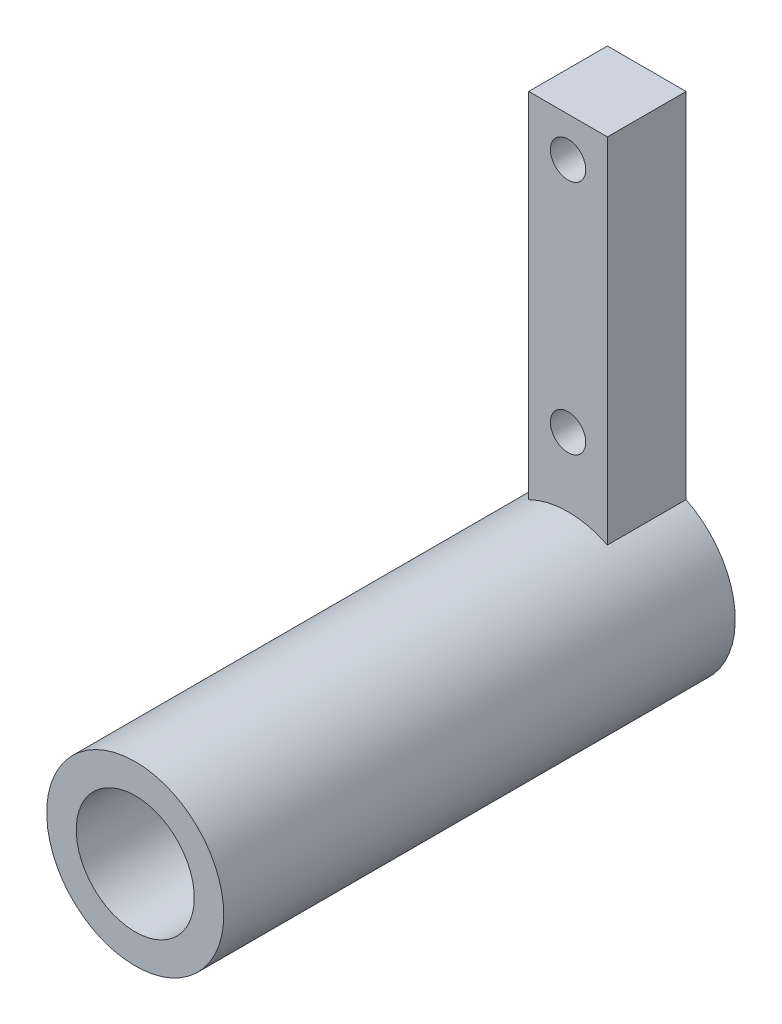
ISO-10303-21;
HEADER;
FILE_DESCRIPTION(('STEP AP214'),'2;1');
FILE_NAME('part.step','',(''),(''),'','','');
FILE_SCHEMA(('AUTOMOTIVE_DESIGN { 1 0 10303 214 1 1 1 1 }'));
ENDSEC;
DATA;
#1=APPLICATION_CONTEXT('core data for automotive mechanical design processes');
#2=APPLICATION_PROTOCOL_DEFINITION('international standard','automotive_design',2000,#1);
#3=PRODUCT_CONTEXT('',#1,'mechanical');
#4=PRODUCT('Part','Part','',(#3));
#5=PRODUCT_RELATED_PRODUCT_CATEGORY('part','',(#4));
#6=PRODUCT_DEFINITION_FORMATION('','',#4);
#7=PRODUCT_DEFINITION_CONTEXT('part definition',#1,'design');
#8=PRODUCT_DEFINITION('design','',#6,#7);
#9=PRODUCT_DEFINITION_SHAPE('','',#8);
#10=(LENGTH_UNIT() NAMED_UNIT(*) SI_UNIT(.MILLI.,.METRE.));
#11=(NAMED_UNIT(*) PLANE_ANGLE_UNIT() SI_UNIT($,.RADIAN.));
#12=(NAMED_UNIT(*) SI_UNIT($,.STERADIAN.) SOLID_ANGLE_UNIT());
#13=UNCERTAINTY_MEASURE_WITH_UNIT(LENGTH_MEASURE(1.E-05),#10,'distance_accuracy_value','');
#14=(GEOMETRIC_REPRESENTATION_CONTEXT(3) GLOBAL_UNCERTAINTY_ASSIGNED_CONTEXT((#13)) GLOBAL_UNIT_ASSIGNED_CONTEXT((#10,
#11,#12)) REPRESENTATION_CONTEXT('',''));
#15=CARTESIAN_POINT('',(0.,0.,0.));
#16=DIRECTION('',(0.,0.,1.));
#17=DIRECTION('',(1.,0.,0.));
#18=AXIS2_PLACEMENT_3D('',#15,#16,#17);
#19=CARTESIAN_POINT('',(0.,0.,130.));
#20=DIRECTION('',(0.,0.,-1.));
#21=DIRECTION('',(-1.,0.,0.));
#22=AXIS2_PLACEMENT_3D('',#19,#20,#21);
#23=CYLINDRICAL_SURFACE('',#22,22.5);
#24=CARTESIAN_POINT('',(0.,0.,130.));
#25=DIRECTION('',(0.,0.,1.));
#26=DIRECTION('',(1.,0.,0.));
#27=AXIS2_PLACEMENT_3D('',#24,#25,#26);
#28=CIRCLE('',#27,22.5);
#29=CARTESIAN_POINT('',(22.5,0.,130.));
#30=VERTEX_POINT('',#29);
#31=EDGE_CURVE('E39',#30,#30,#28,.T.);
#32=ORIENTED_EDGE('',*,*,#31,.F.);
#33=EDGE_LOOP('',(#32));
#34=FACE_BOUND('',#33,.T.);
#35=DIRECTION('',(0.,0.,-1.));
#36=VECTOR('',#35,1.);
#37=CARTESIAN_POINT('',(-10.,20.1556443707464,130.));
#38=LINE('',#37,#36);
#39=CARTESIAN_POINT('',(-10.,20.1556443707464,0.));
#40=VERTEX_POINT('',#39);
#41=CARTESIAN_POINT('',(-10.,20.1556443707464,20.));
#42=VERTEX_POINT('',#41);
#43=EDGE_CURVE('E91',#40,#42,#38,.F.);
#44=ORIENTED_EDGE('',*,*,#43,.F.);
#45=CARTESIAN_POINT('',(0.,0.,0.));
#46=DIRECTION('',(0.,0.,1.));
#47=DIRECTION('',(1.,0.,0.));
#48=AXIS2_PLACEMENT_3D('',#45,#46,#47);
#49=CIRCLE('',#48,22.5);
#50=CARTESIAN_POINT('',(10.,20.1556443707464,0.));
#51=VERTEX_POINT('',#50);
#52=EDGE_CURVE('E99',#40,#51,#49,.T.);
#53=ORIENTED_EDGE('',*,*,#52,.T.);
#54=DIRECTION('',(0.,0.,-1.));
#55=VECTOR('',#54,1.);
#56=CARTESIAN_POINT('',(10.,20.1556443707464,130.));
#57=LINE('',#56,#55);
#58=CARTESIAN_POINT('',(10.,20.1556443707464,20.));
#59=VERTEX_POINT('',#58);
#60=EDGE_CURVE('E49',#59,#51,#57,.T.);
#61=ORIENTED_EDGE('',*,*,#60,.F.);
#62=CARTESIAN_POINT('',(0.,0.,20.));
#63=DIRECTION('',(0.,0.,-1.));
#64=DIRECTION('',(-1.,0.,0.));
#65=AXIS2_PLACEMENT_3D('',#62,#63,#64);
#66=CIRCLE('',#65,22.5);
#67=EDGE_CURVE('E11',#42,#59,#66,.T.);
#68=ORIENTED_EDGE('',*,*,#67,.F.);
#69=EDGE_LOOP('',(#44,#53,#61,#68));
#70=FACE_BOUND('',#69,.T.);
#71=ADVANCED_FACE('F32',(#34,#70),#23,.T.);
#72=CARTESIAN_POINT('',(0.,0.,130.));
#73=DIRECTION('',(0.,0.,1.));
#74=DIRECTION('',(1.,0.,0.));
#75=AXIS2_PLACEMENT_3D('',#72,#73,#74);
#76=PLANE('',#75);
#77=CARTESIAN_POINT('',(0.,0.,130.));
#78=DIRECTION('',(0.,0.,1.));
#79=DIRECTION('',(1.,0.,0.));
#80=AXIS2_PLACEMENT_3D('',#77,#78,#79);
#81=CIRCLE('',#80,15.);
#82=CARTESIAN_POINT('',(15.,0.,130.));
#83=VERTEX_POINT('',#82);
#84=EDGE_CURVE('E127',#83,#83,#81,.T.);
#85=ORIENTED_EDGE('',*,*,#84,.F.);
#86=EDGE_LOOP('',(#85));
#87=FACE_BOUND('',#86,.T.);
#88=ORIENTED_EDGE('',*,*,#31,.T.);
#89=EDGE_LOOP('',(#88));
#90=FACE_BOUND('',#89,.T.);
#91=ADVANCED_FACE('F103',(#87,#90),#76,.T.);
#92=CARTESIAN_POINT('',(0.,0.,0.));
#93=DIRECTION('',(0.,0.,1.));
#94=DIRECTION('',(1.,0.,0.));
#95=AXIS2_PLACEMENT_3D('',#92,#93,#94);
#96=PLANE('',#95);
#97=CARTESIAN_POINT('',(0.,40.,0.));
#98=DIRECTION('',(0.,0.,1.));
#99=DIRECTION('',(1.,0.,0.));
#100=AXIS2_PLACEMENT_3D('',#97,#98,#99);
#101=CIRCLE('',#100,4.50000000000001);
#102=CARTESIAN_POINT('',(4.50000000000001,40.,0.));
#103=VERTEX_POINT('',#102);
#104=EDGE_CURVE('E118',#103,#103,#101,.T.);
#105=ORIENTED_EDGE('',*,*,#104,.T.);
#106=EDGE_LOOP('',(#105));
#107=FACE_BOUND('',#106,.T.);
#108=CARTESIAN_POINT('',(0.,100.,0.));
#109=DIRECTION('',(0.,0.,1.));
#110=DIRECTION('',(1.,0.,0.));
#111=AXIS2_PLACEMENT_3D('',#108,#109,#110);
#112=CIRCLE('',#111,4.5);
#113=CARTESIAN_POINT('',(4.5,100.,0.));
#114=VERTEX_POINT('',#113);
#115=EDGE_CURVE('E88',#114,#114,#112,.T.);
#116=ORIENTED_EDGE('',*,*,#115,.T.);
#117=EDGE_LOOP('',(#116));
#118=FACE_BOUND('',#117,.T.);
#119=ORIENTED_EDGE('',*,*,#52,.F.);
#120=DIRECTION('',(0.,-1.,0.));
#121=VECTOR('',#120,1.);
#122=CARTESIAN_POINT('',(-10.,110.,0.));
#123=LINE('',#122,#121);
#124=CARTESIAN_POINT('',(-10.,110.,0.));
#125=VERTEX_POINT('',#124);
#126=EDGE_CURVE('E106',#125,#40,#123,.T.);
#127=ORIENTED_EDGE('',*,*,#126,.F.);
#128=DIRECTION('',(-1.,0.,0.));
#129=VECTOR('',#128,1.);
#130=CARTESIAN_POINT('',(-10.,110.,0.));
#131=LINE('',#130,#129);
#132=CARTESIAN_POINT('',(10.,110.,0.));
#133=VERTEX_POINT('',#132);
#134=EDGE_CURVE('E84',#133,#125,#131,.T.);
#135=ORIENTED_EDGE('',*,*,#134,.F.);
#136=DIRECTION('',(0.,-1.,0.));
#137=VECTOR('',#136,1.);
#138=CARTESIAN_POINT('',(10.,110.,0.));
#139=LINE('',#138,#137);
#140=EDGE_CURVE('E94',#133,#51,#139,.T.);
#141=ORIENTED_EDGE('',*,*,#140,.T.);
#142=EDGE_LOOP('',(#119,#127,#135,#141));
#143=FACE_BOUND('',#142,.T.);
#144=ADVANCED_FACE('F134',(#107,#118,#143),#96,.F.);
#145=CARTESIAN_POINT('',(-10.,110.,20.));
#146=DIRECTION('',(0.,0.,-1.));
#147=DIRECTION('',(-1.,0.,0.));
#148=AXIS2_PLACEMENT_3D('',#145,#146,#147);
#149=PLANE('',#148);
#150=CARTESIAN_POINT('',(0.,40.,20.));
#151=DIRECTION('',(0.,0.,1.));
#152=DIRECTION('',(1.,0.,0.));
#153=AXIS2_PLACEMENT_3D('',#150,#151,#152);
#154=CIRCLE('',#153,4.50000000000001);
#155=CARTESIAN_POINT('',(4.50000000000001,40.,20.));
#156=VERTEX_POINT('',#155);
#157=EDGE_CURVE('E121',#156,#156,#154,.T.);
#158=ORIENTED_EDGE('',*,*,#157,.F.);
#159=EDGE_LOOP('',(#158));
#160=FACE_BOUND('',#159,.T.);
#161=CARTESIAN_POINT('',(0.,100.,20.));
#162=DIRECTION('',(0.,0.,1.));
#163=DIRECTION('',(1.,0.,0.));
#164=AXIS2_PLACEMENT_3D('',#161,#162,#163);
#165=CIRCLE('',#164,4.5);
#166=CARTESIAN_POINT('',(4.5,100.,20.));
#167=VERTEX_POINT('',#166);
#168=EDGE_CURVE('E115',#167,#167,#165,.T.);
#169=ORIENTED_EDGE('',*,*,#168,.F.);
#170=EDGE_LOOP('',(#169));
#171=FACE_BOUND('',#170,.T.);
#172=DIRECTION('',(0.,-1.,0.));
#173=VECTOR('',#172,1.);
#174=CARTESIAN_POINT('',(-10.,110.,20.));
#175=LINE('',#174,#173);
#176=CARTESIAN_POINT('',(-10.,110.,20.));
#177=VERTEX_POINT('',#176);
#178=EDGE_CURVE('E73',#177,#42,#175,.T.);
#179=ORIENTED_EDGE('',*,*,#178,.T.);
#180=ORIENTED_EDGE('',*,*,#67,.T.);
#181=DIRECTION('',(0.,-1.,0.));
#182=VECTOR('',#181,1.);
#183=CARTESIAN_POINT('',(10.,110.,20.));
#184=LINE('',#183,#182);
#185=CARTESIAN_POINT('',(10.,110.,20.));
#186=VERTEX_POINT('',#185);
#187=EDGE_CURVE('E75',#186,#59,#184,.T.);
#188=ORIENTED_EDGE('',*,*,#187,.F.);
#189=DIRECTION('',(1.,0.,0.));
#190=VECTOR('',#189,1.);
#191=CARTESIAN_POINT('',(-10.,110.,20.));
#192=LINE('',#191,#190);
#193=EDGE_CURVE('E69',#177,#186,#192,.T.);
#194=ORIENTED_EDGE('',*,*,#193,.F.);
#195=EDGE_LOOP('',(#179,#180,#188,#194));
#196=FACE_BOUND('',#195,.T.);
#197=ADVANCED_FACE('F71',(#160,#171,#196),#149,.F.);
#198=CARTESIAN_POINT('',(-10.,110.,0.));
#199=DIRECTION('',(1.,0.,0.));
#200=DIRECTION('',(0.,0.,-1.));
#201=AXIS2_PLACEMENT_3D('',#198,#199,#200);
#202=PLANE('',#201);
#203=ORIENTED_EDGE('',*,*,#126,.T.);
#204=ORIENTED_EDGE('',*,*,#43,.T.);
#205=ORIENTED_EDGE('',*,*,#178,.F.);
#206=DIRECTION('',(0.,0.,1.));
#207=VECTOR('',#206,1.);
#208=CARTESIAN_POINT('',(-10.,110.,0.));
#209=LINE('',#208,#207);
#210=EDGE_CURVE('E79',#125,#177,#209,.T.);
#211=ORIENTED_EDGE('',*,*,#210,.F.);
#212=EDGE_LOOP('',(#203,#204,#205,#211));
#213=FACE_BOUND('',#212,.T.);
#214=ADVANCED_FACE('F90',(#213),#202,.F.);
#215=CARTESIAN_POINT('',(10.,110.,0.));
#216=DIRECTION('',(-1.,0.,0.));
#217=DIRECTION('',(0.,0.,1.));
#218=AXIS2_PLACEMENT_3D('',#215,#216,#217);
#219=PLANE('',#218);
#220=ORIENTED_EDGE('',*,*,#187,.T.);
#221=ORIENTED_EDGE('',*,*,#60,.T.);
#222=ORIENTED_EDGE('',*,*,#140,.F.);
#223=DIRECTION('',(0.,0.,-1.));
#224=VECTOR('',#223,1.);
#225=CARTESIAN_POINT('',(10.,110.,0.));
#226=LINE('',#225,#224);
#227=EDGE_CURVE('E78',#186,#133,#226,.T.);
#228=ORIENTED_EDGE('',*,*,#227,.F.);
#229=EDGE_LOOP('',(#220,#221,#222,#228));
#230=FACE_BOUND('',#229,.T.);
#231=ADVANCED_FACE('F143',(#230),#219,.F.);
#232=CARTESIAN_POINT('',(-10.,110.,20.));
#233=DIRECTION('',(0.,1.,0.));
#234=DIRECTION('',(0.,0.,1.));
#235=AXIS2_PLACEMENT_3D('',#232,#233,#234);
#236=PLANE('',#235);
#237=ORIENTED_EDGE('',*,*,#210,.T.);
#238=ORIENTED_EDGE('',*,*,#193,.T.);
#239=ORIENTED_EDGE('',*,*,#227,.T.);
#240=ORIENTED_EDGE('',*,*,#134,.T.);
#241=EDGE_LOOP('',(#237,#238,#239,#240));
#242=FACE_BOUND('',#241,.T.);
#243=ADVANCED_FACE('F82',(#242),#236,.T.);
#244=CARTESIAN_POINT('',(0.,100.,0.));
#245=DIRECTION('',(0.,0.,1.));
#246=DIRECTION('',(1.,0.,0.));
#247=AXIS2_PLACEMENT_3D('',#244,#245,#246);
#248=CYLINDRICAL_SURFACE('',#247,4.5);
#249=ORIENTED_EDGE('',*,*,#115,.F.);
#250=EDGE_LOOP('',(#249));
#251=FACE_BOUND('',#250,.T.);
#252=ORIENTED_EDGE('',*,*,#168,.T.);
#253=EDGE_LOOP('',(#252));
#254=FACE_BOUND('',#253,.T.);
#255=ADVANCED_FACE('F152',(#251,#254),#248,.F.);
#256=CARTESIAN_POINT('',(0.,40.,0.));
#257=DIRECTION('',(0.,0.,1.));
#258=DIRECTION('',(1.,0.,0.));
#259=AXIS2_PLACEMENT_3D('',#256,#257,#258);
#260=CYLINDRICAL_SURFACE('',#259,4.50000000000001);
#261=ORIENTED_EDGE('',*,*,#104,.F.);
#262=EDGE_LOOP('',(#261));
#263=FACE_BOUND('',#262,.T.);
#264=ORIENTED_EDGE('',*,*,#157,.T.);
#265=EDGE_LOOP('',(#264));
#266=FACE_BOUND('',#265,.T.);
#267=ADVANCED_FACE('F155',(#263,#266),#260,.F.);
#268=CARTESIAN_POINT('',(0.,0.,10.));
#269=DIRECTION('',(0.,0.,1.));
#270=DIRECTION('',(1.,0.,0.));
#271=AXIS2_PLACEMENT_3D('',#268,#269,#270);
#272=CYLINDRICAL_SURFACE('',#271,15.);
#273=CARTESIAN_POINT('',(0.,0.,10.));
#274=DIRECTION('',(0.,0.,1.));
#275=DIRECTION('',(1.,0.,0.));
#276=AXIS2_PLACEMENT_3D('',#273,#274,#275);
#277=CIRCLE('',#276,15.);
#278=CARTESIAN_POINT('',(15.,0.,10.));
#279=VERTEX_POINT('',#278);
#280=EDGE_CURVE('E124',#279,#279,#277,.T.);
#281=ORIENTED_EDGE('',*,*,#280,.F.);
#282=EDGE_LOOP('',(#281));
#283=FACE_BOUND('',#282,.T.);
#284=ORIENTED_EDGE('',*,*,#84,.T.);
#285=EDGE_LOOP('',(#284));
#286=FACE_BOUND('',#285,.T.);
#287=ADVANCED_FACE('F131',(#283,#286),#272,.F.);
#288=CARTESIAN_POINT('',(0.,0.,10.));
#289=DIRECTION('',(0.,0.,1.));
#290=DIRECTION('',(1.,0.,0.));
#291=AXIS2_PLACEMENT_3D('',#288,#289,#290);
#292=PLANE('',#291);
#293=ORIENTED_EDGE('',*,*,#280,.T.);
#294=EDGE_LOOP('',(#293));
#295=FACE_BOUND('',#294,.T.);
#296=ADVANCED_FACE('F162',(#295),#292,.T.);
#297=CLOSED_SHELL('',(#71,#91,#144,#197,#214,#231,#243,#255,#267,#287,#296));
#298=MANIFOLD_SOLID_BREP('B2',#297);
#299=ADVANCED_BREP_SHAPE_REPRESENTATION('',(#18,#298),#14);
#300=SHAPE_DEFINITION_REPRESENTATION(#9,#299);
ENDSEC;
END-ISO-10303-21;
